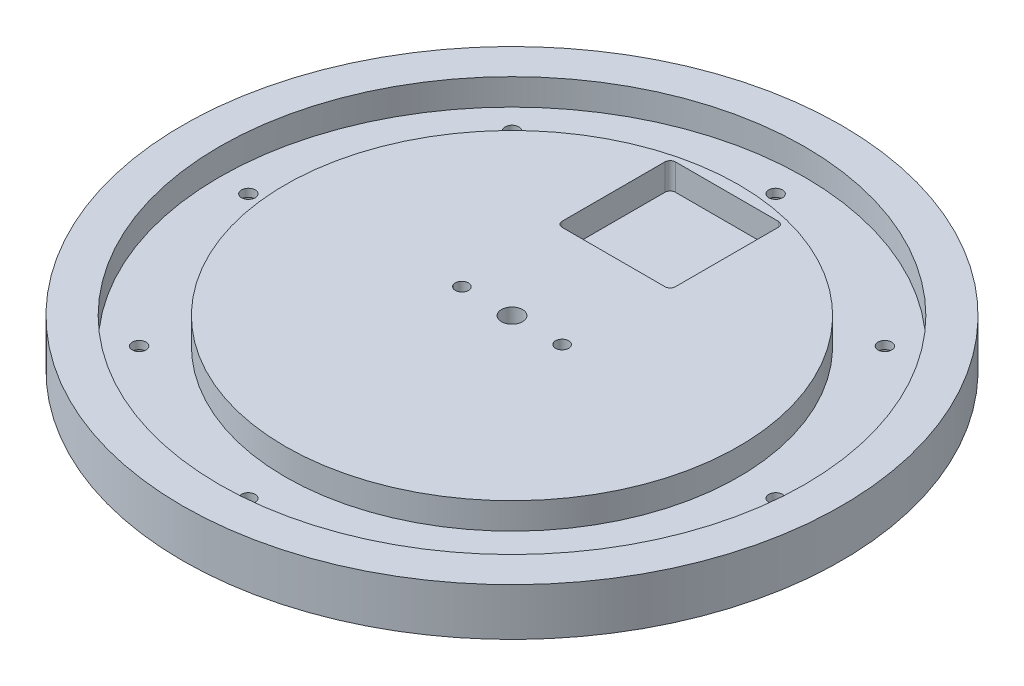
ISO-10303-21;
HEADER;
FILE_DESCRIPTION(('STEP AP214'),'2;1');
FILE_NAME('part.step','',(''),(''),'','','');
FILE_SCHEMA(('AUTOMOTIVE_DESIGN { 1 0 10303 214 1 1 1 1 }'));
ENDSEC;
DATA;
#1=APPLICATION_CONTEXT('core data for automotive mechanical design processes');
#2=APPLICATION_PROTOCOL_DEFINITION('international standard','automotive_design',2000,#1);
#3=PRODUCT_CONTEXT('',#1,'mechanical');
#4=PRODUCT('Part','Part','',(#3));
#5=PRODUCT_RELATED_PRODUCT_CATEGORY('part','',(#4));
#6=PRODUCT_DEFINITION_FORMATION('','',#4);
#7=PRODUCT_DEFINITION_CONTEXT('part definition',#1,'design');
#8=PRODUCT_DEFINITION('design','',#6,#7);
#9=PRODUCT_DEFINITION_SHAPE('','',#8);
#10=(LENGTH_UNIT() NAMED_UNIT(*) SI_UNIT(.MILLI.,.METRE.));
#11=(NAMED_UNIT(*) PLANE_ANGLE_UNIT() SI_UNIT($,.RADIAN.));
#12=(NAMED_UNIT(*) SI_UNIT($,.STERADIAN.) SOLID_ANGLE_UNIT());
#13=UNCERTAINTY_MEASURE_WITH_UNIT(LENGTH_MEASURE(1.E-05),#10,'distance_accuracy_value','');
#14=(GEOMETRIC_REPRESENTATION_CONTEXT(3) GLOBAL_UNCERTAINTY_ASSIGNED_CONTEXT((#13)) GLOBAL_UNIT_ASSIGNED_CONTEXT((#10,
#11,#12)) REPRESENTATION_CONTEXT('',''));
#15=CARTESIAN_POINT('',(0.,0.,0.));
#16=DIRECTION('',(0.,0.,1.));
#17=DIRECTION('',(1.,0.,0.));
#18=AXIS2_PLACEMENT_3D('',#15,#16,#17);
#19=CARTESIAN_POINT('',(0.,0.,0.));
#20=DIRECTION('',(0.,1.,0.));
#21=DIRECTION('',(0.,0.,1.));
#22=AXIS2_PLACEMENT_3D('',#19,#20,#21);
#23=CYLINDRICAL_SURFACE('',#22,4.);
#24=CARTESIAN_POINT('',(0.,18.,0.));
#25=DIRECTION('',(0.,1.,0.));
#26=DIRECTION('',(0.,0.,1.));
#27=AXIS2_PLACEMENT_3D('',#24,#25,#26);
#28=CIRCLE('',#27,4.);
#29=CARTESIAN_POINT('',(0.,18.,4.));
#30=VERTEX_POINT('',#29);
#31=EDGE_CURVE('E193',#30,#30,#28,.T.);
#32=ORIENTED_EDGE('',*,*,#31,.T.);
#33=EDGE_LOOP('',(#32));
#34=FACE_BOUND('',#33,.T.);
#35=CARTESIAN_POINT('',(0.,8.,0.));
#36=DIRECTION('',(0.,-1.,0.));
#37=DIRECTION('',(0.,0.,-1.));
#38=AXIS2_PLACEMENT_3D('',#35,#36,#37);
#39=CIRCLE('',#38,4.);
#40=CARTESIAN_POINT('',(0.,8.,-4.));
#41=VERTEX_POINT('',#40);
#42=EDGE_CURVE('E147',#41,#41,#39,.F.);
#43=ORIENTED_EDGE('',*,*,#42,.F.);
#44=EDGE_LOOP('',(#43));
#45=FACE_BOUND('',#44,.T.);
#46=ADVANCED_FACE('F33',(#34,#45),#23,.F.);
#47=CARTESIAN_POINT('',(100.,10.,0.));
#48=DIRECTION('',(0.,-1.,0.));
#49=DIRECTION('',(0.,0.,-1.));
#50=AXIS2_PLACEMENT_3D('',#47,#48,#49);
#51=CYLINDRICAL_SURFACE('',#50,2.6);
#52=CARTESIAN_POINT('',(100.,8.,0.));
#53=DIRECTION('',(0.,1.,0.));
#54=DIRECTION('',(0.,0.,1.));
#55=AXIS2_PLACEMENT_3D('',#52,#53,#54);
#56=CIRCLE('',#55,2.6);
#57=CARTESIAN_POINT('',(100.,8.,2.6));
#58=VERTEX_POINT('',#57);
#59=EDGE_CURVE('E209',#58,#58,#56,.T.);
#60=ORIENTED_EDGE('',*,*,#59,.T.);
#61=EDGE_LOOP('',(#60));
#62=FACE_BOUND('',#61,.T.);
#63=CARTESIAN_POINT('',(100.,5.,0.));
#64=DIRECTION('',(0.,-1.,0.));
#65=DIRECTION('',(0.,0.,-1.));
#66=AXIS2_PLACEMENT_3D('',#63,#64,#65);
#67=CIRCLE('',#66,2.6);
#68=CARTESIAN_POINT('',(100.,5.,-2.6));
#69=VERTEX_POINT('',#68);
#70=EDGE_CURVE('E201',#69,#69,#67,.F.);
#71=ORIENTED_EDGE('',*,*,#70,.F.);
#72=EDGE_LOOP('',(#71));
#73=FACE_BOUND('',#72,.T.);
#74=ADVANCED_FACE('F327',(#62,#73),#51,.F.);
#75=CARTESIAN_POINT('',(70.7106781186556,10.,70.7106781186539));
#76=DIRECTION('',(0.,-1.,0.));
#77=DIRECTION('',(0.,0.,-1.));
#78=AXIS2_PLACEMENT_3D('',#75,#76,#77);
#79=CYLINDRICAL_SURFACE('',#78,2.6);
#80=CARTESIAN_POINT('',(70.7106781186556,8.,70.7106781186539));
#81=DIRECTION('',(0.,1.,0.));
#82=DIRECTION('',(0.,0.,1.));
#83=AXIS2_PLACEMENT_3D('',#80,#81,#82);
#84=CIRCLE('',#83,2.6);
#85=CARTESIAN_POINT('',(70.7106781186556,8.,73.3106781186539));
#86=VERTEX_POINT('',#85);
#87=EDGE_CURVE('E224',#86,#86,#84,.T.);
#88=ORIENTED_EDGE('',*,*,#87,.T.);
#89=EDGE_LOOP('',(#88));
#90=FACE_BOUND('',#89,.T.);
#91=CARTESIAN_POINT('',(70.7106781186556,5.,70.7106781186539));
#92=DIRECTION('',(0.,-1.,0.));
#93=DIRECTION('',(0.,0.,-1.));
#94=AXIS2_PLACEMENT_3D('',#91,#92,#93);
#95=CIRCLE('',#94,2.6);
#96=CARTESIAN_POINT('',(70.7106781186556,5.,68.1106781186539));
#97=VERTEX_POINT('',#96);
#98=EDGE_CURVE('E260',#97,#97,#95,.F.);
#99=ORIENTED_EDGE('',*,*,#98,.F.);
#100=EDGE_LOOP('',(#99));
#101=FACE_BOUND('',#100,.T.);
#102=ADVANCED_FACE('F335',(#90,#101),#79,.F.);
#103=CARTESIAN_POINT('',(-70.7106781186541,10.,70.7106781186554));
#104=DIRECTION('',(0.,-1.,0.));
#105=DIRECTION('',(0.,0.,-1.));
#106=AXIS2_PLACEMENT_3D('',#103,#104,#105);
#107=CYLINDRICAL_SURFACE('',#106,2.6);
#108=CARTESIAN_POINT('',(-70.7106781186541,8.,70.7106781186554));
#109=DIRECTION('',(0.,1.,0.));
#110=DIRECTION('',(0.,0.,1.));
#111=AXIS2_PLACEMENT_3D('',#108,#109,#110);
#112=CIRCLE('',#111,2.6);
#113=CARTESIAN_POINT('',(-70.7106781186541,8.,73.3106781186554));
#114=VERTEX_POINT('',#113);
#115=EDGE_CURVE('E230',#114,#114,#112,.T.);
#116=ORIENTED_EDGE('',*,*,#115,.T.);
#117=EDGE_LOOP('',(#116));
#118=FACE_BOUND('',#117,.T.);
#119=CARTESIAN_POINT('',(-70.7106781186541,5.,70.7106781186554));
#120=DIRECTION('',(0.,-1.,0.));
#121=DIRECTION('',(0.,0.,-1.));
#122=AXIS2_PLACEMENT_3D('',#119,#120,#121);
#123=CIRCLE('',#122,2.6);
#124=CARTESIAN_POINT('',(-70.7106781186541,5.,68.1106781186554));
#125=VERTEX_POINT('',#124);
#126=EDGE_CURVE('E257',#125,#125,#123,.F.);
#127=ORIENTED_EDGE('',*,*,#126,.F.);
#128=EDGE_LOOP('',(#127));
#129=FACE_BOUND('',#128,.T.);
#130=ADVANCED_FACE('F423',(#118,#129),#107,.F.);
#131=CARTESIAN_POINT('',(-100.,10.,6.98296267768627E-13));
#132=DIRECTION('',(0.,-1.,0.));
#133=DIRECTION('',(0.,0.,-1.));
#134=AXIS2_PLACEMENT_3D('',#131,#132,#133);
#135=CYLINDRICAL_SURFACE('',#134,2.6);
#136=CARTESIAN_POINT('',(-100.,8.,6.98296267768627E-13));
#137=DIRECTION('',(0.,1.,0.));
#138=DIRECTION('',(0.,0.,1.));
#139=AXIS2_PLACEMENT_3D('',#136,#137,#138);
#140=CIRCLE('',#139,2.6);
#141=CARTESIAN_POINT('',(-100.,8.,2.6000000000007));
#142=VERTEX_POINT('',#141);
#143=EDGE_CURVE('E233',#142,#142,#140,.T.);
#144=ORIENTED_EDGE('',*,*,#143,.T.);
#145=EDGE_LOOP('',(#144));
#146=FACE_BOUND('',#145,.T.);
#147=CARTESIAN_POINT('',(-100.,5.,6.98296267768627E-13));
#148=DIRECTION('',(0.,-1.,0.));
#149=DIRECTION('',(0.,0.,-1.));
#150=AXIS2_PLACEMENT_3D('',#147,#148,#149);
#151=CIRCLE('',#150,2.6);
#152=CARTESIAN_POINT('',(-100.,5.,-2.59999999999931));
#153=VERTEX_POINT('',#152);
#154=EDGE_CURVE('E254',#153,#153,#151,.F.);
#155=ORIENTED_EDGE('',*,*,#154,.F.);
#156=EDGE_LOOP('',(#155));
#157=FACE_BOUND('',#156,.T.);
#158=ADVANCED_FACE('F419',(#146,#157),#135,.F.);
#159=CARTESIAN_POINT('',(-70.7106781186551,10.,-70.7106781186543));
#160=DIRECTION('',(0.,-1.,0.));
#161=DIRECTION('',(0.,0.,-1.));
#162=AXIS2_PLACEMENT_3D('',#159,#160,#161);
#163=CYLINDRICAL_SURFACE('',#162,2.6);
#164=CARTESIAN_POINT('',(-70.7106781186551,8.,-70.7106781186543));
#165=DIRECTION('',(0.,1.,0.));
#166=DIRECTION('',(0.,0.,1.));
#167=AXIS2_PLACEMENT_3D('',#164,#165,#166);
#168=CIRCLE('',#167,2.6);
#169=CARTESIAN_POINT('',(-70.7106781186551,8.,-68.1106781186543));
#170=VERTEX_POINT('',#169);
#171=EDGE_CURVE('E236',#170,#170,#168,.T.);
#172=ORIENTED_EDGE('',*,*,#171,.T.);
#173=EDGE_LOOP('',(#172));
#174=FACE_BOUND('',#173,.T.);
#175=CARTESIAN_POINT('',(-70.7106781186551,5.,-70.7106781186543));
#176=DIRECTION('',(0.,-1.,0.));
#177=DIRECTION('',(0.,0.,-1.));
#178=AXIS2_PLACEMENT_3D('',#175,#176,#177);
#179=CIRCLE('',#178,2.6);
#180=CARTESIAN_POINT('',(-70.7106781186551,5.,-73.3106781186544));
#181=VERTEX_POINT('',#180);
#182=EDGE_CURVE('E251',#181,#181,#179,.F.);
#183=ORIENTED_EDGE('',*,*,#182,.F.);
#184=EDGE_LOOP('',(#183));
#185=FACE_BOUND('',#184,.T.);
#186=ADVANCED_FACE('F415',(#174,#185),#163,.F.);
#187=CARTESIAN_POINT('',(-3.49148133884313E-13,10.,-100.));
#188=DIRECTION('',(0.,-1.,0.));
#189=DIRECTION('',(0.,0.,-1.));
#190=AXIS2_PLACEMENT_3D('',#187,#188,#189);
#191=CYLINDRICAL_SURFACE('',#190,2.6);
#192=CARTESIAN_POINT('',(-3.49148133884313E-13,8.,-100.));
#193=DIRECTION('',(0.,1.,0.));
#194=DIRECTION('',(0.,0.,1.));
#195=AXIS2_PLACEMENT_3D('',#192,#193,#194);
#196=CIRCLE('',#195,2.6);
#197=CARTESIAN_POINT('',(-3.49148133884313E-13,8.,-97.4));
#198=VERTEX_POINT('',#197);
#199=EDGE_CURVE('E239',#198,#198,#196,.T.);
#200=ORIENTED_EDGE('',*,*,#199,.T.);
#201=EDGE_LOOP('',(#200));
#202=FACE_BOUND('',#201,.T.);
#203=CARTESIAN_POINT('',(-3.49148133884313E-13,5.,-100.));
#204=DIRECTION('',(0.,-1.,0.));
#205=DIRECTION('',(0.,0.,-1.));
#206=AXIS2_PLACEMENT_3D('',#203,#204,#205);
#207=CIRCLE('',#206,2.6);
#208=CARTESIAN_POINT('',(-3.49148133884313E-13,5.,-102.6));
#209=VERTEX_POINT('',#208);
#210=EDGE_CURVE('E248',#209,#209,#207,.F.);
#211=ORIENTED_EDGE('',*,*,#210,.F.);
#212=EDGE_LOOP('',(#211));
#213=FACE_BOUND('',#212,.T.);
#214=ADVANCED_FACE('F411',(#202,#213),#191,.F.);
#215=CARTESIAN_POINT('',(70.7106781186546,10.,-70.7106781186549));
#216=DIRECTION('',(0.,-1.,0.));
#217=DIRECTION('',(0.,0.,-1.));
#218=AXIS2_PLACEMENT_3D('',#215,#216,#217);
#219=CYLINDRICAL_SURFACE('',#218,2.6);
#220=CARTESIAN_POINT('',(70.7106781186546,8.,-70.7106781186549));
#221=DIRECTION('',(0.,1.,0.));
#222=DIRECTION('',(0.,0.,1.));
#223=AXIS2_PLACEMENT_3D('',#220,#221,#222);
#224=CIRCLE('',#223,2.6);
#225=CARTESIAN_POINT('',(70.7106781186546,8.,-68.1106781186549));
#226=VERTEX_POINT('',#225);
#227=EDGE_CURVE('E223',#226,#226,#224,.T.);
#228=ORIENTED_EDGE('',*,*,#227,.T.);
#229=EDGE_LOOP('',(#228));
#230=FACE_BOUND('',#229,.T.);
#231=CARTESIAN_POINT('',(70.7106781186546,5.,-70.7106781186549));
#232=DIRECTION('',(0.,-1.,0.));
#233=DIRECTION('',(0.,0.,-1.));
#234=AXIS2_PLACEMENT_3D('',#231,#232,#233);
#235=CIRCLE('',#234,2.6);
#236=CARTESIAN_POINT('',(70.7106781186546,5.,-73.3106781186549));
#237=VERTEX_POINT('',#236);
#238=EDGE_CURVE('E153',#237,#237,#235,.F.);
#239=ORIENTED_EDGE('',*,*,#238,.F.);
#240=EDGE_LOOP('',(#239));
#241=FACE_BOUND('',#240,.T.);
#242=ADVANCED_FACE('F407',(#230,#241),#219,.F.);
#243=CARTESIAN_POINT('',(1.04744440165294E-12,10.,100.));
#244=DIRECTION('',(0.,-1.,0.));
#245=DIRECTION('',(0.,0.,-1.));
#246=AXIS2_PLACEMENT_3D('',#243,#244,#245);
#247=CYLINDRICAL_SURFACE('',#246,2.6);
#248=CARTESIAN_POINT('',(1.04744440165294E-12,8.,100.));
#249=DIRECTION('',(0.,1.,0.));
#250=DIRECTION('',(0.,0.,1.));
#251=AXIS2_PLACEMENT_3D('',#248,#249,#250);
#252=CIRCLE('',#251,2.6);
#253=CARTESIAN_POINT('',(1.04744440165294E-12,8.,102.6));
#254=VERTEX_POINT('',#253);
#255=EDGE_CURVE('E227',#254,#254,#252,.T.);
#256=ORIENTED_EDGE('',*,*,#255,.T.);
#257=EDGE_LOOP('',(#256));
#258=FACE_BOUND('',#257,.T.);
#259=CARTESIAN_POINT('',(1.04744440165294E-12,5.,100.));
#260=DIRECTION('',(0.,-1.,0.));
#261=DIRECTION('',(0.,0.,-1.));
#262=AXIS2_PLACEMENT_3D('',#259,#260,#261);
#263=CIRCLE('',#262,2.6);
#264=CARTESIAN_POINT('',(1.04744440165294E-12,5.,97.4));
#265=VERTEX_POINT('',#264);
#266=EDGE_CURVE('E197',#265,#265,#263,.F.);
#267=ORIENTED_EDGE('',*,*,#266,.F.);
#268=EDGE_LOOP('',(#267));
#269=FACE_BOUND('',#268,.T.);
#270=ADVANCED_FACE('F410',(#258,#269),#247,.F.);
#271=CARTESIAN_POINT('',(0.,18.,0.));
#272=DIRECTION('',(0.,-1.,0.));
#273=DIRECTION('',(0.,0.,-1.));
#274=AXIS2_PLACEMENT_3D('',#271,#272,#273);
#275=CYLINDRICAL_SURFACE('',#274,125.);
#276=CARTESIAN_POINT('',(0.,18.,0.));
#277=DIRECTION('',(0.,1.,0.));
#278=DIRECTION('',(0.,0.,1.));
#279=AXIS2_PLACEMENT_3D('',#276,#277,#278);
#280=CIRCLE('',#279,125.);
#281=CARTESIAN_POINT('',(0.,18.,125.));
#282=VERTEX_POINT('',#281);
#283=EDGE_CURVE('E216',#282,#282,#280,.T.);
#284=ORIENTED_EDGE('',*,*,#283,.F.);
#285=EDGE_LOOP('',(#284));
#286=FACE_BOUND('',#285,.T.);
#287=CARTESIAN_POINT('',(0.,0.,0.));
#288=DIRECTION('',(0.,1.,0.));
#289=DIRECTION('',(0.,0.,1.));
#290=AXIS2_PLACEMENT_3D('',#287,#288,#289);
#291=CIRCLE('',#290,125.);
#292=CARTESIAN_POINT('',(0.,0.,125.));
#293=VERTEX_POINT('',#292);
#294=EDGE_CURVE('E213',#293,#293,#291,.T.);
#295=ORIENTED_EDGE('',*,*,#294,.T.);
#296=EDGE_LOOP('',(#295));
#297=FACE_BOUND('',#296,.T.);
#298=ADVANCED_FACE('F430',(#286,#297),#275,.T.);
#299=CARTESIAN_POINT('',(0.,18.,0.));
#300=DIRECTION('',(0.,1.,0.));
#301=DIRECTION('',(0.,0.,1.));
#302=AXIS2_PLACEMENT_3D('',#299,#300,#301);
#303=PLANE('',#302);
#304=CARTESIAN_POINT('',(0.,18.,0.));
#305=DIRECTION('',(0.,1.,0.));
#306=DIRECTION('',(0.,0.,1.));
#307=AXIS2_PLACEMENT_3D('',#304,#305,#306);
#308=CIRCLE('',#307,111.);
#309=CARTESIAN_POINT('',(0.,18.,111.));
#310=VERTEX_POINT('',#309);
#311=EDGE_CURVE('E205',#310,#310,#308,.T.);
#312=ORIENTED_EDGE('',*,*,#311,.F.);
#313=EDGE_LOOP('',(#312));
#314=FACE_BOUND('',#313,.T.);
#315=ORIENTED_EDGE('',*,*,#283,.T.);
#316=EDGE_LOOP('',(#315));
#317=FACE_BOUND('',#316,.T.);
#318=ADVANCED_FACE('F448',(#314,#317),#303,.T.);
#319=CARTESIAN_POINT('',(0.,0.,0.));
#320=DIRECTION('',(0.,1.,0.));
#321=DIRECTION('',(0.,0.,1.));
#322=AXIS2_PLACEMENT_3D('',#319,#320,#321);
#323=PLANE('',#322);
#324=CARTESIAN_POINT('',(-19.,0.,0.));
#325=DIRECTION('',(0.,1.,0.));
#326=DIRECTION('',(0.,0.,1.));
#327=AXIS2_PLACEMENT_3D('',#324,#325,#326);
#328=CIRCLE('',#327,2.5);
#329=CARTESIAN_POINT('',(-19.,0.,2.5));
#330=VERTEX_POINT('',#329);
#331=EDGE_CURVE('E130',#330,#330,#328,.T.);
#332=ORIENTED_EDGE('',*,*,#331,.T.);
#333=EDGE_LOOP('',(#332));
#334=FACE_BOUND('',#333,.T.);
#335=CARTESIAN_POINT('',(19.,0.,0.));
#336=DIRECTION('',(0.,1.,0.));
#337=DIRECTION('',(0.,0.,1.));
#338=AXIS2_PLACEMENT_3D('',#335,#336,#337);
#339=CIRCLE('',#338,2.5);
#340=CARTESIAN_POINT('',(19.,0.,2.5));
#341=VERTEX_POINT('',#340);
#342=EDGE_CURVE('E138',#341,#341,#339,.T.);
#343=ORIENTED_EDGE('',*,*,#342,.T.);
#344=EDGE_LOOP('',(#343));
#345=FACE_BOUND('',#344,.T.);
#346=CARTESIAN_POINT('',(0.,0.,0.));
#347=DIRECTION('',(0.,-1.,0.));
#348=DIRECTION('',(0.,0.,-1.));
#349=AXIS2_PLACEMENT_3D('',#346,#347,#348);
#350=CIRCLE('',#349,10.);
#351=CARTESIAN_POINT('',(0.,0.,-10.));
#352=VERTEX_POINT('',#351);
#353=EDGE_CURVE('E141',#352,#352,#350,.T.);
#354=ORIENTED_EDGE('',*,*,#353,.F.);
#355=EDGE_LOOP('',(#354));
#356=FACE_BOUND('',#355,.T.);
#357=CARTESIAN_POINT('',(70.710678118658,0.,70.71067811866));
#358=DIRECTION('',(0.,-1.,0.));
#359=DIRECTION('',(0.,0.,-1.));
#360=AXIS2_PLACEMENT_3D('',#357,#358,#359);
#361=CIRCLE('',#360,5.00000000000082);
#362=CARTESIAN_POINT('',(70.710678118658,0.,65.7106781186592));
#363=VERTEX_POINT('',#362);
#364=EDGE_CURVE('E154',#363,#363,#361,.T.);
#365=ORIENTED_EDGE('',*,*,#364,.F.);
#366=EDGE_LOOP('',(#365));
#367=FACE_BOUND('',#366,.T.);
#368=CARTESIAN_POINT('',(100.000000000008,0.,7.44845225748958E-12));
#369=DIRECTION('',(0.,-1.,0.));
#370=DIRECTION('',(0.,0.,-1.));
#371=AXIS2_PLACEMENT_3D('',#368,#369,#370);
#372=CIRCLE('',#371,5.00000000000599);
#373=CARTESIAN_POINT('',(100.000000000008,0.,-4.99999999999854));
#374=VERTEX_POINT('',#373);
#375=EDGE_CURVE('E160',#374,#374,#372,.T.);
#376=ORIENTED_EDGE('',*,*,#375,.F.);
#377=EDGE_LOOP('',(#376));
#378=FACE_BOUND('',#377,.T.);
#379=CARTESIAN_POINT('',(70.7106781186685,0.,-70.7106781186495));
#380=DIRECTION('',(0.,-1.,0.));
#381=DIRECTION('',(0.,0.,-1.));
#382=AXIS2_PLACEMENT_3D('',#379,#380,#381);
#383=CIRCLE('',#382,5.00000000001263);
#384=CARTESIAN_POINT('',(70.7106781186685,0.,-75.7106781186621));
#385=VERTEX_POINT('',#384);
#386=EDGE_CURVE('E166',#385,#385,#383,.T.);
#387=ORIENTED_EDGE('',*,*,#386,.F.);
#388=EDGE_LOOP('',(#387));
#389=FACE_BOUND('',#388,.T.);
#390=CARTESIAN_POINT('',(1.59443489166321E-11,0.,-100.));
#391=DIRECTION('',(0.,-1.,0.));
#392=DIRECTION('',(0.,0.,-1.));
#393=AXIS2_PLACEMENT_3D('',#390,#391,#392);
#394=CIRCLE('',#393,5.00000000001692);
#395=CARTESIAN_POINT('',(1.59443489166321E-11,0.,-105.000000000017));
#396=VERTEX_POINT('',#395);
#397=EDGE_CURVE('E172',#396,#396,#394,.T.);
#398=ORIENTED_EDGE('',*,*,#397,.F.);
#399=EDGE_LOOP('',(#398));
#400=FACE_BOUND('',#399,.T.);
#401=CARTESIAN_POINT('',(-70.710678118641,0.,-70.71067811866));
#402=DIRECTION('',(0.,-1.,0.));
#403=DIRECTION('',(0.,0.,-1.));
#404=AXIS2_PLACEMENT_3D('',#401,#402,#403);
#405=CIRCLE('',#404,5.00000000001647);
#406=CARTESIAN_POINT('',(-70.710678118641,0.,-75.7106781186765));
#407=VERTEX_POINT('',#406);
#408=EDGE_CURVE('E178',#407,#407,#405,.T.);
#409=ORIENTED_EDGE('',*,*,#408,.F.);
#410=EDGE_LOOP('',(#409));
#411=FACE_BOUND('',#410,.T.);
#412=CARTESIAN_POINT('',(-99.9999999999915,0.,-7.46069872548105E-12));
#413=DIRECTION('',(0.,-1.,0.));
#414=DIRECTION('',(0.,0.,-1.));
#415=AXIS2_PLACEMENT_3D('',#412,#413,#414);
#416=CIRCLE('',#415,5.00000000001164);
#417=CARTESIAN_POINT('',(-99.9999999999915,0.,-5.0000000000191));
#418=VERTEX_POINT('',#417);
#419=EDGE_CURVE('E184',#418,#418,#416,.T.);
#420=ORIENTED_EDGE('',*,*,#419,.F.);
#421=EDGE_LOOP('',(#420));
#422=FACE_BOUND('',#421,.T.);
#423=CARTESIAN_POINT('',(-70.7106781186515,0.,70.7106781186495));
#424=DIRECTION('',(0.,-1.,0.));
#425=DIRECTION('',(0.,0.,-1.));
#426=AXIS2_PLACEMENT_3D('',#423,#424,#425);
#427=CIRCLE('',#426,5.00000000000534);
#428=CARTESIAN_POINT('',(-70.7106781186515,0.,65.7106781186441));
#429=VERTEX_POINT('',#428);
#430=EDGE_CURVE('E190',#429,#429,#427,.T.);
#431=ORIENTED_EDGE('',*,*,#430,.F.);
#432=EDGE_LOOP('',(#431));
#433=FACE_BOUND('',#432,.T.);
#434=CARTESIAN_POINT('',(1.04744440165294E-12,0.,100.));
#435=DIRECTION('',(0.,-1.,0.));
#436=DIRECTION('',(0.,0.,-1.));
#437=AXIS2_PLACEMENT_3D('',#434,#435,#436);
#438=CIRCLE('',#437,5.);
#439=CARTESIAN_POINT('',(1.04744440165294E-12,0.,95.));
#440=VERTEX_POINT('',#439);
#441=EDGE_CURVE('E198',#440,#440,#438,.T.);
#442=ORIENTED_EDGE('',*,*,#441,.F.);
#443=EDGE_LOOP('',(#442));
#444=FACE_BOUND('',#443,.T.);
#445=ORIENTED_EDGE('',*,*,#294,.F.);
#446=EDGE_LOOP('',(#445));
#447=FACE_BOUND('',#446,.T.);
#448=ADVANCED_FACE('F446',(#334,#345,#356,#367,#378,#389,#400,#411,#422,#433,#444,#447),#323,.F.);
#449=CARTESIAN_POINT('',(0.,8.,0.));
#450=DIRECTION('',(0.,1.,0.));
#451=DIRECTION('',(0.,0.,1.));
#452=AXIS2_PLACEMENT_3D('',#449,#450,#451);
#453=CYLINDRICAL_SURFACE('',#452,111.);
#454=CARTESIAN_POINT('',(0.,8.,0.));
#455=DIRECTION('',(0.,1.,0.));
#456=DIRECTION('',(0.,0.,1.));
#457=AXIS2_PLACEMENT_3D('',#454,#455,#456);
#458=CIRCLE('',#457,111.);
#459=CARTESIAN_POINT('',(0.,8.,111.));
#460=VERTEX_POINT('',#459);
#461=EDGE_CURVE('E210',#460,#460,#458,.T.);
#462=ORIENTED_EDGE('',*,*,#461,.F.);
#463=EDGE_LOOP('',(#462));
#464=FACE_BOUND('',#463,.T.);
#465=ORIENTED_EDGE('',*,*,#311,.T.);
#466=EDGE_LOOP('',(#465));
#467=FACE_BOUND('',#466,.T.);
#468=ADVANCED_FACE('F442',(#464,#467),#453,.F.);
#469=CARTESIAN_POINT('',(0.,8.,0.));
#470=DIRECTION('',(0.,1.,0.));
#471=DIRECTION('',(0.,0.,1.));
#472=AXIS2_PLACEMENT_3D('',#469,#470,#471);
#473=PLANE('',#472);
#474=ORIENTED_EDGE('',*,*,#227,.F.);
#475=EDGE_LOOP('',(#474));
#476=FACE_BOUND('',#475,.T.);
#477=ORIENTED_EDGE('',*,*,#199,.F.);
#478=EDGE_LOOP('',(#477));
#479=FACE_BOUND('',#478,.T.);
#480=ORIENTED_EDGE('',*,*,#171,.F.);
#481=EDGE_LOOP('',(#480));
#482=FACE_BOUND('',#481,.T.);
#483=ORIENTED_EDGE('',*,*,#143,.F.);
#484=EDGE_LOOP('',(#483));
#485=FACE_BOUND('',#484,.T.);
#486=ORIENTED_EDGE('',*,*,#115,.F.);
#487=EDGE_LOOP('',(#486));
#488=FACE_BOUND('',#487,.T.);
#489=ORIENTED_EDGE('',*,*,#255,.F.);
#490=EDGE_LOOP('',(#489));
#491=FACE_BOUND('',#490,.T.);
#492=ORIENTED_EDGE('',*,*,#87,.F.);
#493=EDGE_LOOP('',(#492));
#494=FACE_BOUND('',#493,.T.);
#495=ORIENTED_EDGE('',*,*,#59,.F.);
#496=EDGE_LOOP('',(#495));
#497=FACE_BOUND('',#496,.T.);
#498=CARTESIAN_POINT('',(0.,8.,0.));
#499=DIRECTION('',(0.,1.,0.));
#500=DIRECTION('',(0.,0.,1.));
#501=AXIS2_PLACEMENT_3D('',#498,#499,#500);
#502=CIRCLE('',#501,86.);
#503=CARTESIAN_POINT('',(0.,8.,86.));
#504=VERTEX_POINT('',#503);
#505=EDGE_CURVE('E202',#504,#504,#502,.T.);
#506=ORIENTED_EDGE('',*,*,#505,.F.);
#507=EDGE_LOOP('',(#506));
#508=FACE_BOUND('',#507,.T.);
#509=ORIENTED_EDGE('',*,*,#461,.T.);
#510=EDGE_LOOP('',(#509));
#511=FACE_BOUND('',#510,.T.);
#512=ADVANCED_FACE('F438',(#476,#479,#482,#485,#488,#491,#494,#497,#508,#511),#473,.T.);
#513=CARTESIAN_POINT('',(0.,8.,0.));
#514=DIRECTION('',(0.,1.,0.));
#515=DIRECTION('',(0.,0.,1.));
#516=AXIS2_PLACEMENT_3D('',#513,#514,#515);
#517=CYLINDRICAL_SURFACE('',#516,86.);
#518=ORIENTED_EDGE('',*,*,#505,.T.);
#519=EDGE_LOOP('',(#518));
#520=FACE_BOUND('',#519,.T.);
#521=CARTESIAN_POINT('',(0.,18.,0.));
#522=DIRECTION('',(0.,1.,0.));
#523=DIRECTION('',(0.,0.,1.));
#524=AXIS2_PLACEMENT_3D('',#521,#522,#523);
#525=CIRCLE('',#524,86.);
#526=CARTESIAN_POINT('',(0.,18.,86.));
#527=VERTEX_POINT('',#526);
#528=EDGE_CURVE('E206',#527,#527,#525,.T.);
#529=ORIENTED_EDGE('',*,*,#528,.F.);
#530=EDGE_LOOP('',(#529));
#531=FACE_BOUND('',#530,.T.);
#532=ADVANCED_FACE('F435',(#520,#531),#517,.T.);
#533=DIRECTION('',(0.,0.,1.));
#534=VECTOR('',#533,1.);
#535=CARTESIAN_POINT('',(-21.5,18.,-81.5));
#536=LINE('',#535,#534);
#537=CARTESIAN_POINT('',(-21.5,18.,-79.5));
#538=VERTEX_POINT('',#537);
#539=CARTESIAN_POINT('',(-21.5,18.,-40.5));
#540=VERTEX_POINT('',#539);
#541=EDGE_CURVE('E126',#538,#540,#536,.T.);
#542=ORIENTED_EDGE('',*,*,#541,.F.);
#543=CARTESIAN_POINT('',(-19.5,18.,-79.5));
#544=DIRECTION('',(0.,1.,0.));
#545=DIRECTION('',(0.,0.,1.));
#546=AXIS2_PLACEMENT_3D('',#543,#544,#545);
#547=CIRCLE('',#546,2.);
#548=CARTESIAN_POINT('',(-19.5,18.,-81.5));
#549=VERTEX_POINT('',#548);
#550=EDGE_CURVE('E11',#538,#549,#547,.F.);
#551=ORIENTED_EDGE('',*,*,#550,.T.);
#552=DIRECTION('',(-1.,0.,0.));
#553=VECTOR('',#552,1.);
#554=CARTESIAN_POINT('',(-21.5,18.,-81.5));
#555=LINE('',#554,#553);
#556=CARTESIAN_POINT('',(19.5,18.,-81.5));
#557=VERTEX_POINT('',#556);
#558=EDGE_CURVE('E121',#557,#549,#555,.T.);
#559=ORIENTED_EDGE('',*,*,#558,.F.);
#560=CARTESIAN_POINT('',(19.5,18.,-79.5));
#561=DIRECTION('',(0.,1.,0.));
#562=DIRECTION('',(0.,0.,1.));
#563=AXIS2_PLACEMENT_3D('',#560,#561,#562);
#564=CIRCLE('',#563,2.);
#565=CARTESIAN_POINT('',(21.5,18.,-79.5));
#566=VERTEX_POINT('',#565);
#567=EDGE_CURVE('E41',#557,#566,#564,.F.);
#568=ORIENTED_EDGE('',*,*,#567,.T.);
#569=DIRECTION('',(0.,0.,-1.));
#570=VECTOR('',#569,1.);
#571=CARTESIAN_POINT('',(21.5,18.,-81.5));
#572=LINE('',#571,#570);
#573=CARTESIAN_POINT('',(21.5,18.,-40.5));
#574=VERTEX_POINT('',#573);
#575=EDGE_CURVE('E113',#574,#566,#572,.T.);
#576=ORIENTED_EDGE('',*,*,#575,.F.);
#577=CARTESIAN_POINT('',(19.5,18.,-40.5));
#578=DIRECTION('',(0.,1.,0.));
#579=DIRECTION('',(0.,0.,1.));
#580=AXIS2_PLACEMENT_3D('',#577,#578,#579);
#581=CIRCLE('',#580,2.);
#582=CARTESIAN_POINT('',(19.5,18.,-38.5));
#583=VERTEX_POINT('',#582);
#584=EDGE_CURVE('E97',#574,#583,#581,.F.);
#585=ORIENTED_EDGE('',*,*,#584,.T.);
#586=DIRECTION('',(1.,0.,0.));
#587=VECTOR('',#586,1.);
#588=CARTESIAN_POINT('',(-21.5,18.,-38.5));
#589=LINE('',#588,#587);
#590=CARTESIAN_POINT('',(-19.5,18.,-38.5));
#591=VERTEX_POINT('',#590);
#592=EDGE_CURVE('E122',#591,#583,#589,.T.);
#593=ORIENTED_EDGE('',*,*,#592,.F.);
#594=CARTESIAN_POINT('',(-19.5,18.,-40.5));
#595=DIRECTION('',(0.,1.,0.));
#596=DIRECTION('',(0.,0.,1.));
#597=AXIS2_PLACEMENT_3D('',#594,#595,#596);
#598=CIRCLE('',#597,2.);
#599=EDGE_CURVE('E106',#591,#540,#598,.F.);
#600=ORIENTED_EDGE('',*,*,#599,.T.);
#601=EDGE_LOOP('',(#542,#551,#559,#568,#576,#585,#593,#600));
#602=FACE_BOUND('',#601,.T.);
#603=CARTESIAN_POINT('',(-19.,18.,0.));
#604=DIRECTION('',(0.,1.,0.));
#605=DIRECTION('',(0.,0.,1.));
#606=AXIS2_PLACEMENT_3D('',#603,#604,#605);
#607=CIRCLE('',#606,2.5);
#608=CARTESIAN_POINT('',(-19.,18.,2.5));
#609=VERTEX_POINT('',#608);
#610=EDGE_CURVE('E134',#609,#609,#607,.T.);
#611=ORIENTED_EDGE('',*,*,#610,.F.);
#612=EDGE_LOOP('',(#611));
#613=FACE_BOUND('',#612,.T.);
#614=CARTESIAN_POINT('',(19.,18.,0.));
#615=DIRECTION('',(0.,1.,0.));
#616=DIRECTION('',(0.,0.,1.));
#617=AXIS2_PLACEMENT_3D('',#614,#615,#616);
#618=CIRCLE('',#617,2.5);
#619=CARTESIAN_POINT('',(19.,18.,2.5));
#620=VERTEX_POINT('',#619);
#621=EDGE_CURVE('E133',#620,#620,#618,.T.);
#622=ORIENTED_EDGE('',*,*,#621,.F.);
#623=EDGE_LOOP('',(#622));
#624=FACE_BOUND('',#623,.T.);
#625=ORIENTED_EDGE('',*,*,#31,.F.);
#626=EDGE_LOOP('',(#625));
#627=FACE_BOUND('',#626,.T.);
#628=ORIENTED_EDGE('',*,*,#528,.T.);
#629=EDGE_LOOP('',(#628));
#630=FACE_BOUND('',#629,.T.);
#631=ADVANCED_FACE('F119',(#602,#613,#624,#627,#630),#303,.T.);
#632=CARTESIAN_POINT('',(1.04744440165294E-12,5.,100.));
#633=DIRECTION('',(0.,-1.,0.));
#634=DIRECTION('',(0.,0.,-1.));
#635=AXIS2_PLACEMENT_3D('',#632,#633,#634);
#636=PLANE('',#635);
#637=CARTESIAN_POINT('',(1.04744440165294E-12,5.,100.));
#638=DIRECTION('',(0.,-1.,0.));
#639=DIRECTION('',(0.,0.,-1.));
#640=AXIS2_PLACEMENT_3D('',#637,#638,#639);
#641=CIRCLE('',#640,5.);
#642=CARTESIAN_POINT('',(1.04744440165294E-12,5.,95.));
#643=VERTEX_POINT('',#642);
#644=EDGE_CURVE('E194',#643,#643,#641,.T.);
#645=ORIENTED_EDGE('',*,*,#644,.T.);
#646=EDGE_LOOP('',(#645));
#647=FACE_BOUND('',#646,.T.);
#648=ORIENTED_EDGE('',*,*,#266,.T.);
#649=EDGE_LOOP('',(#648));
#650=FACE_BOUND('',#649,.T.);
#651=ADVANCED_FACE('F400',(#647,#650),#636,.T.);
#652=CARTESIAN_POINT('',(1.04744440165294E-12,5.,100.));
#653=DIRECTION('',(0.,-1.,0.));
#654=DIRECTION('',(0.,0.,-1.));
#655=AXIS2_PLACEMENT_3D('',#652,#653,#654);
#656=CYLINDRICAL_SURFACE('',#655,5.);
#657=ORIENTED_EDGE('',*,*,#644,.F.);
#658=EDGE_LOOP('',(#657));
#659=FACE_BOUND('',#658,.T.);
#660=ORIENTED_EDGE('',*,*,#441,.T.);
#661=EDGE_LOOP('',(#660));
#662=FACE_BOUND('',#661,.T.);
#663=ADVANCED_FACE('F364',(#659,#662),#656,.F.);
#664=CARTESIAN_POINT('',(70.7106781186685,5.,-70.7106781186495));
#665=DIRECTION('',(0.,-1.,0.));
#666=DIRECTION('',(0.,0.,-1.));
#667=AXIS2_PLACEMENT_3D('',#664,#665,#666);
#668=PLANE('',#667);
#669=CARTESIAN_POINT('',(70.7106781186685,5.,-70.7106781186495));
#670=DIRECTION('',(0.,-1.,0.));
#671=DIRECTION('',(0.,0.,-1.));
#672=AXIS2_PLACEMENT_3D('',#669,#670,#671);
#673=CIRCLE('',#672,5.00000000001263);
#674=CARTESIAN_POINT('',(70.7106781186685,5.,-75.7106781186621));
#675=VERTEX_POINT('',#674);
#676=EDGE_CURVE('E163',#675,#675,#673,.T.);
#677=ORIENTED_EDGE('',*,*,#676,.T.);
#678=EDGE_LOOP('',(#677));
#679=FACE_BOUND('',#678,.T.);
#680=ORIENTED_EDGE('',*,*,#238,.T.);
#681=EDGE_LOOP('',(#680));
#682=FACE_BOUND('',#681,.T.);
#683=ADVANCED_FACE('F360',(#679,#682),#668,.T.);
#684=CARTESIAN_POINT('',(70.7106781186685,5.,-70.7106781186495));
#685=DIRECTION('',(0.,-1.,0.));
#686=DIRECTION('',(0.,0.,-1.));
#687=AXIS2_PLACEMENT_3D('',#684,#685,#686);
#688=CYLINDRICAL_SURFACE('',#687,5.00000000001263);
#689=ORIENTED_EDGE('',*,*,#676,.F.);
#690=EDGE_LOOP('',(#689));
#691=FACE_BOUND('',#690,.T.);
#692=ORIENTED_EDGE('',*,*,#386,.T.);
#693=EDGE_LOOP('',(#692));
#694=FACE_BOUND('',#693,.T.);
#695=ADVANCED_FACE('F363',(#691,#694),#688,.F.);
#696=CARTESIAN_POINT('',(1.59443489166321E-11,5.,-100.));
#697=DIRECTION('',(0.,-1.,0.));
#698=DIRECTION('',(0.,0.,-1.));
#699=AXIS2_PLACEMENT_3D('',#696,#697,#698);
#700=PLANE('',#699);
#701=CARTESIAN_POINT('',(1.59443489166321E-11,5.,-100.));
#702=DIRECTION('',(0.,-1.,0.));
#703=DIRECTION('',(0.,0.,-1.));
#704=AXIS2_PLACEMENT_3D('',#701,#702,#703);
#705=CIRCLE('',#704,5.00000000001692);
#706=CARTESIAN_POINT('',(1.59443489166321E-11,5.,-105.000000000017));
#707=VERTEX_POINT('',#706);
#708=EDGE_CURVE('E169',#707,#707,#705,.T.);
#709=ORIENTED_EDGE('',*,*,#708,.T.);
#710=EDGE_LOOP('',(#709));
#711=FACE_BOUND('',#710,.T.);
#712=ORIENTED_EDGE('',*,*,#210,.T.);
#713=EDGE_LOOP('',(#712));
#714=FACE_BOUND('',#713,.T.);
#715=ADVANCED_FACE('F368',(#711,#714),#700,.T.);
#716=CARTESIAN_POINT('',(1.59443489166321E-11,5.,-100.));
#717=DIRECTION('',(0.,-1.,0.));
#718=DIRECTION('',(0.,0.,-1.));
#719=AXIS2_PLACEMENT_3D('',#716,#717,#718);
#720=CYLINDRICAL_SURFACE('',#719,5.00000000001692);
#721=ORIENTED_EDGE('',*,*,#708,.F.);
#722=EDGE_LOOP('',(#721));
#723=FACE_BOUND('',#722,.T.);
#724=ORIENTED_EDGE('',*,*,#397,.T.);
#725=EDGE_LOOP('',(#724));
#726=FACE_BOUND('',#725,.T.);
#727=ADVANCED_FACE('F372',(#723,#726),#720,.F.);
#728=CARTESIAN_POINT('',(-70.710678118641,5.,-70.71067811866));
#729=DIRECTION('',(0.,-1.,0.));
#730=DIRECTION('',(0.,0.,-1.));
#731=AXIS2_PLACEMENT_3D('',#728,#729,#730);
#732=PLANE('',#731);
#733=CARTESIAN_POINT('',(-70.710678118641,5.,-70.71067811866));
#734=DIRECTION('',(0.,-1.,0.));
#735=DIRECTION('',(0.,0.,-1.));
#736=AXIS2_PLACEMENT_3D('',#733,#734,#735);
#737=CIRCLE('',#736,5.00000000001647);
#738=CARTESIAN_POINT('',(-70.710678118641,5.,-75.7106781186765));
#739=VERTEX_POINT('',#738);
#740=EDGE_CURVE('E175',#739,#739,#737,.T.);
#741=ORIENTED_EDGE('',*,*,#740,.T.);
#742=EDGE_LOOP('',(#741));
#743=FACE_BOUND('',#742,.T.);
#744=ORIENTED_EDGE('',*,*,#182,.T.);
#745=EDGE_LOOP('',(#744));
#746=FACE_BOUND('',#745,.T.);
#747=ADVANCED_FACE('F376',(#743,#746),#732,.T.);
#748=CARTESIAN_POINT('',(-70.710678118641,5.,-70.71067811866));
#749=DIRECTION('',(0.,-1.,0.));
#750=DIRECTION('',(0.,0.,-1.));
#751=AXIS2_PLACEMENT_3D('',#748,#749,#750);
#752=CYLINDRICAL_SURFACE('',#751,5.00000000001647);
#753=ORIENTED_EDGE('',*,*,#740,.F.);
#754=EDGE_LOOP('',(#753));
#755=FACE_BOUND('',#754,.T.);
#756=ORIENTED_EDGE('',*,*,#408,.T.);
#757=EDGE_LOOP('',(#756));
#758=FACE_BOUND('',#757,.T.);
#759=ADVANCED_FACE('F380',(#755,#758),#752,.F.);
#760=CARTESIAN_POINT('',(-99.9999999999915,5.,-7.46069872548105E-12));
#761=DIRECTION('',(0.,-1.,0.));
#762=DIRECTION('',(0.,0.,-1.));
#763=AXIS2_PLACEMENT_3D('',#760,#761,#762);
#764=PLANE('',#763);
#765=CARTESIAN_POINT('',(-99.9999999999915,5.,-7.46069872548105E-12));
#766=DIRECTION('',(0.,-1.,0.));
#767=DIRECTION('',(0.,0.,-1.));
#768=AXIS2_PLACEMENT_3D('',#765,#766,#767);
#769=CIRCLE('',#768,5.00000000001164);
#770=CARTESIAN_POINT('',(-99.9999999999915,5.,-5.0000000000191));
#771=VERTEX_POINT('',#770);
#772=EDGE_CURVE('E181',#771,#771,#769,.T.);
#773=ORIENTED_EDGE('',*,*,#772,.T.);
#774=EDGE_LOOP('',(#773));
#775=FACE_BOUND('',#774,.T.);
#776=ORIENTED_EDGE('',*,*,#154,.T.);
#777=EDGE_LOOP('',(#776));
#778=FACE_BOUND('',#777,.T.);
#779=ADVANCED_FACE('F384',(#775,#778),#764,.T.);
#780=CARTESIAN_POINT('',(-99.9999999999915,5.,-7.46069872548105E-12));
#781=DIRECTION('',(0.,-1.,0.));
#782=DIRECTION('',(0.,0.,-1.));
#783=AXIS2_PLACEMENT_3D('',#780,#781,#782);
#784=CYLINDRICAL_SURFACE('',#783,5.00000000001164);
#785=ORIENTED_EDGE('',*,*,#772,.F.);
#786=EDGE_LOOP('',(#785));
#787=FACE_BOUND('',#786,.T.);
#788=ORIENTED_EDGE('',*,*,#419,.T.);
#789=EDGE_LOOP('',(#788));
#790=FACE_BOUND('',#789,.T.);
#791=ADVANCED_FACE('F388',(#787,#790),#784,.F.);
#792=CARTESIAN_POINT('',(-70.7106781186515,5.,70.7106781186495));
#793=DIRECTION('',(0.,-1.,0.));
#794=DIRECTION('',(0.,0.,-1.));
#795=AXIS2_PLACEMENT_3D('',#792,#793,#794);
#796=PLANE('',#795);
#797=CARTESIAN_POINT('',(-70.7106781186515,5.,70.7106781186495));
#798=DIRECTION('',(0.,-1.,0.));
#799=DIRECTION('',(0.,0.,-1.));
#800=AXIS2_PLACEMENT_3D('',#797,#798,#799);
#801=CIRCLE('',#800,5.00000000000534);
#802=CARTESIAN_POINT('',(-70.7106781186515,5.,65.7106781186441));
#803=VERTEX_POINT('',#802);
#804=EDGE_CURVE('E187',#803,#803,#801,.T.);
#805=ORIENTED_EDGE('',*,*,#804,.T.);
#806=EDGE_LOOP('',(#805));
#807=FACE_BOUND('',#806,.T.);
#808=ORIENTED_EDGE('',*,*,#126,.T.);
#809=EDGE_LOOP('',(#808));
#810=FACE_BOUND('',#809,.T.);
#811=ADVANCED_FACE('F392',(#807,#810),#796,.T.);
#812=CARTESIAN_POINT('',(-70.7106781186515,5.,70.7106781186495));
#813=DIRECTION('',(0.,-1.,0.));
#814=DIRECTION('',(0.,0.,-1.));
#815=AXIS2_PLACEMENT_3D('',#812,#813,#814);
#816=CYLINDRICAL_SURFACE('',#815,5.00000000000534);
#817=ORIENTED_EDGE('',*,*,#804,.F.);
#818=EDGE_LOOP('',(#817));
#819=FACE_BOUND('',#818,.T.);
#820=ORIENTED_EDGE('',*,*,#430,.T.);
#821=EDGE_LOOP('',(#820));
#822=FACE_BOUND('',#821,.T.);
#823=ADVANCED_FACE('F347',(#819,#822),#816,.F.);
#824=CARTESIAN_POINT('',(70.710678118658,5.,70.71067811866));
#825=DIRECTION('',(0.,-1.,0.));
#826=DIRECTION('',(0.,0.,-1.));
#827=AXIS2_PLACEMENT_3D('',#824,#825,#826);
#828=PLANE('',#827);
#829=CARTESIAN_POINT('',(70.710678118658,5.,70.71067811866));
#830=DIRECTION('',(0.,-1.,0.));
#831=DIRECTION('',(0.,0.,-1.));
#832=AXIS2_PLACEMENT_3D('',#829,#830,#831);
#833=CIRCLE('',#832,5.00000000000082);
#834=CARTESIAN_POINT('',(70.710678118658,5.,65.7106781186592));
#835=VERTEX_POINT('',#834);
#836=EDGE_CURVE('E150',#835,#835,#833,.T.);
#837=ORIENTED_EDGE('',*,*,#836,.T.);
#838=EDGE_LOOP('',(#837));
#839=FACE_BOUND('',#838,.T.);
#840=ORIENTED_EDGE('',*,*,#98,.T.);
#841=EDGE_LOOP('',(#840));
#842=FACE_BOUND('',#841,.T.);
#843=ADVANCED_FACE('F343',(#839,#842),#828,.T.);
#844=CARTESIAN_POINT('',(70.710678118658,5.,70.71067811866));
#845=DIRECTION('',(0.,-1.,0.));
#846=DIRECTION('',(0.,0.,-1.));
#847=AXIS2_PLACEMENT_3D('',#844,#845,#846);
#848=CYLINDRICAL_SURFACE('',#847,5.00000000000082);
#849=ORIENTED_EDGE('',*,*,#836,.F.);
#850=EDGE_LOOP('',(#849));
#851=FACE_BOUND('',#850,.T.);
#852=ORIENTED_EDGE('',*,*,#364,.T.);
#853=EDGE_LOOP('',(#852));
#854=FACE_BOUND('',#853,.T.);
#855=ADVANCED_FACE('F346',(#851,#854),#848,.F.);
#856=CARTESIAN_POINT('',(100.000000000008,5.,7.44845225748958E-12));
#857=DIRECTION('',(0.,-1.,0.));
#858=DIRECTION('',(0.,0.,-1.));
#859=AXIS2_PLACEMENT_3D('',#856,#857,#858);
#860=PLANE('',#859);
#861=CARTESIAN_POINT('',(100.000000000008,5.,7.44845225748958E-12));
#862=DIRECTION('',(0.,-1.,0.));
#863=DIRECTION('',(0.,0.,-1.));
#864=AXIS2_PLACEMENT_3D('',#861,#862,#863);
#865=CIRCLE('',#864,5.00000000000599);
#866=CARTESIAN_POINT('',(100.000000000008,5.,-4.99999999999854));
#867=VERTEX_POINT('',#866);
#868=EDGE_CURVE('E157',#867,#867,#865,.T.);
#869=ORIENTED_EDGE('',*,*,#868,.T.);
#870=EDGE_LOOP('',(#869));
#871=FACE_BOUND('',#870,.T.);
#872=ORIENTED_EDGE('',*,*,#70,.T.);
#873=EDGE_LOOP('',(#872));
#874=FACE_BOUND('',#873,.T.);
#875=ADVANCED_FACE('F351',(#871,#874),#860,.T.);
#876=CARTESIAN_POINT('',(100.000000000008,5.,7.44845225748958E-12));
#877=DIRECTION('',(0.,-1.,0.));
#878=DIRECTION('',(0.,0.,-1.));
#879=AXIS2_PLACEMENT_3D('',#876,#877,#878);
#880=CYLINDRICAL_SURFACE('',#879,5.00000000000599);
#881=ORIENTED_EDGE('',*,*,#868,.F.);
#882=EDGE_LOOP('',(#881));
#883=FACE_BOUND('',#882,.T.);
#884=ORIENTED_EDGE('',*,*,#375,.T.);
#885=EDGE_LOOP('',(#884));
#886=FACE_BOUND('',#885,.T.);
#887=ADVANCED_FACE('F355',(#883,#886),#880,.F.);
#888=CARTESIAN_POINT('',(0.,8.,0.));
#889=DIRECTION('',(0.,-1.,0.));
#890=DIRECTION('',(0.,0.,-1.));
#891=AXIS2_PLACEMENT_3D('',#888,#889,#890);
#892=PLANE('',#891);
#893=CARTESIAN_POINT('',(0.,8.,0.));
#894=DIRECTION('',(0.,-1.,0.));
#895=DIRECTION('',(0.,0.,-1.));
#896=AXIS2_PLACEMENT_3D('',#893,#894,#895);
#897=CIRCLE('',#896,10.);
#898=CARTESIAN_POINT('',(0.,8.,-10.));
#899=VERTEX_POINT('',#898);
#900=EDGE_CURVE('E144',#899,#899,#897,.T.);
#901=ORIENTED_EDGE('',*,*,#900,.T.);
#902=EDGE_LOOP('',(#901));
#903=FACE_BOUND('',#902,.T.);
#904=ORIENTED_EDGE('',*,*,#42,.T.);
#905=EDGE_LOOP('',(#904));
#906=FACE_BOUND('',#905,.T.);
#907=ADVANCED_FACE('F358',(#903,#906),#892,.T.);
#908=CARTESIAN_POINT('',(0.,8.,0.));
#909=DIRECTION('',(0.,-1.,0.));
#910=DIRECTION('',(0.,0.,-1.));
#911=AXIS2_PLACEMENT_3D('',#908,#909,#910);
#912=CYLINDRICAL_SURFACE('',#911,10.);
#913=ORIENTED_EDGE('',*,*,#900,.F.);
#914=EDGE_LOOP('',(#913));
#915=FACE_BOUND('',#914,.T.);
#916=ORIENTED_EDGE('',*,*,#353,.T.);
#917=EDGE_LOOP('',(#916));
#918=FACE_BOUND('',#917,.T.);
#919=ADVANCED_FACE('F341',(#915,#918),#912,.F.);
#920=CARTESIAN_POINT('',(19.,0.,0.));
#921=DIRECTION('',(0.,1.,0.));
#922=DIRECTION('',(0.,0.,1.));
#923=AXIS2_PLACEMENT_3D('',#920,#921,#922);
#924=CYLINDRICAL_SURFACE('',#923,2.5);
#925=ORIENTED_EDGE('',*,*,#342,.F.);
#926=EDGE_LOOP('',(#925));
#927=FACE_BOUND('',#926,.T.);
#928=ORIENTED_EDGE('',*,*,#621,.T.);
#929=EDGE_LOOP('',(#928));
#930=FACE_BOUND('',#929,.T.);
#931=ADVANCED_FACE('F477',(#927,#930),#924,.F.);
#932=CARTESIAN_POINT('',(-19.,0.,0.));
#933=DIRECTION('',(0.,1.,0.));
#934=DIRECTION('',(0.,0.,1.));
#935=AXIS2_PLACEMENT_3D('',#932,#933,#934);
#936=CYLINDRICAL_SURFACE('',#935,2.5);
#937=ORIENTED_EDGE('',*,*,#331,.F.);
#938=EDGE_LOOP('',(#937));
#939=FACE_BOUND('',#938,.T.);
#940=ORIENTED_EDGE('',*,*,#610,.T.);
#941=EDGE_LOOP('',(#940));
#942=FACE_BOUND('',#941,.T.);
#943=ADVANCED_FACE('F474',(#939,#942),#936,.F.);
#944=CARTESIAN_POINT('',(-21.5,8.,-81.5));
#945=DIRECTION('',(-1.,0.,0.));
#946=DIRECTION('',(0.,0.,1.));
#947=AXIS2_PLACEMENT_3D('',#944,#945,#946);
#948=PLANE('',#947);
#949=ORIENTED_EDGE('',*,*,#541,.T.);
#950=DIRECTION('',(0.,1.,0.));
#951=VECTOR('',#950,1.);
#952=CARTESIAN_POINT('',(-21.5,8.,-40.5));
#953=LINE('',#952,#951);
#954=CARTESIAN_POINT('',(-21.5,8.,-40.5));
#955=VERTEX_POINT('',#954);
#956=EDGE_CURVE('E284',#540,#955,#953,.F.);
#957=ORIENTED_EDGE('',*,*,#956,.T.);
#958=DIRECTION('',(0.,0.,1.));
#959=VECTOR('',#958,1.);
#960=CARTESIAN_POINT('',(-21.5,8.,-81.5));
#961=LINE('',#960,#959);
#962=CARTESIAN_POINT('',(-21.5,8.,-79.5));
#963=VERTEX_POINT('',#962);
#964=EDGE_CURVE('E124',#963,#955,#961,.T.);
#965=ORIENTED_EDGE('',*,*,#964,.F.);
#966=DIRECTION('',(0.,1.,0.));
#967=VECTOR('',#966,1.);
#968=CARTESIAN_POINT('',(-21.5,18.,-79.5));
#969=LINE('',#968,#967);
#970=EDGE_CURVE('E281',#963,#538,#969,.T.);
#971=ORIENTED_EDGE('',*,*,#970,.T.);
#972=EDGE_LOOP('',(#949,#957,#965,#971));
#973=FACE_BOUND('',#972,.T.);
#974=ADVANCED_FACE('F294',(#973),#948,.F.);
#975=CARTESIAN_POINT('',(-21.5,8.,-81.5));
#976=DIRECTION('',(0.,0.,-1.));
#977=DIRECTION('',(-1.,0.,0.));
#978=AXIS2_PLACEMENT_3D('',#975,#976,#977);
#979=PLANE('',#978);
#980=DIRECTION('',(-1.,0.,0.));
#981=VECTOR('',#980,1.);
#982=CARTESIAN_POINT('',(-21.5,8.,-81.5));
#983=LINE('',#982,#981);
#984=CARTESIAN_POINT('',(19.5,8.,-81.5));
#985=VERTEX_POINT('',#984);
#986=CARTESIAN_POINT('',(-19.5,8.,-81.5));
#987=VERTEX_POINT('',#986);
#988=EDGE_CURVE('E137',#985,#987,#983,.T.);
#989=ORIENTED_EDGE('',*,*,#988,.F.);
#990=DIRECTION('',(0.,1.,0.));
#991=VECTOR('',#990,1.);
#992=CARTESIAN_POINT('',(19.5,18.,-81.5));
#993=LINE('',#992,#991);
#994=EDGE_CURVE('E107',#985,#557,#993,.T.);
#995=ORIENTED_EDGE('',*,*,#994,.T.);
#996=ORIENTED_EDGE('',*,*,#558,.T.);
#997=DIRECTION('',(0.,1.,0.));
#998=VECTOR('',#997,1.);
#999=CARTESIAN_POINT('',(-19.5,8.,-81.5));
#1000=LINE('',#999,#998);
#1001=EDGE_CURVE('E286',#549,#987,#1000,.F.);
#1002=ORIENTED_EDGE('',*,*,#1001,.T.);
#1003=EDGE_LOOP('',(#989,#995,#996,#1002));
#1004=FACE_BOUND('',#1003,.T.);
#1005=ADVANCED_FACE('F318',(#1004),#979,.F.);
#1006=CARTESIAN_POINT('',(21.5,8.,-81.5));
#1007=DIRECTION('',(1.,0.,0.));
#1008=DIRECTION('',(0.,0.,-1.));
#1009=AXIS2_PLACEMENT_3D('',#1006,#1007,#1008);
#1010=PLANE('',#1009);
#1011=DIRECTION('',(0.,0.,-1.));
#1012=VECTOR('',#1011,1.);
#1013=CARTESIAN_POINT('',(21.5,8.,-81.5));
#1014=LINE('',#1013,#1012);
#1015=CARTESIAN_POINT('',(21.5,8.,-40.5));
#1016=VERTEX_POINT('',#1015);
#1017=CARTESIAN_POINT('',(21.5,8.,-79.5));
#1018=VERTEX_POINT('',#1017);
#1019=EDGE_CURVE('E115',#1016,#1018,#1014,.T.);
#1020=ORIENTED_EDGE('',*,*,#1019,.F.);
#1021=DIRECTION('',(0.,1.,0.));
#1022=VECTOR('',#1021,1.);
#1023=CARTESIAN_POINT('',(21.5,18.,-40.5));
#1024=LINE('',#1023,#1022);
#1025=EDGE_CURVE('E101',#1016,#574,#1024,.T.);
#1026=ORIENTED_EDGE('',*,*,#1025,.T.);
#1027=ORIENTED_EDGE('',*,*,#575,.T.);
#1028=DIRECTION('',(0.,1.,0.));
#1029=VECTOR('',#1028,1.);
#1030=CARTESIAN_POINT('',(21.5,8.,-79.5));
#1031=LINE('',#1030,#1029);
#1032=EDGE_CURVE('E117',#566,#1018,#1031,.F.);
#1033=ORIENTED_EDGE('',*,*,#1032,.T.);
#1034=EDGE_LOOP('',(#1020,#1026,#1027,#1033));
#1035=FACE_BOUND('',#1034,.T.);
#1036=ADVANCED_FACE('F112',(#1035),#1010,.F.);
#1037=CARTESIAN_POINT('',(-21.5,8.,-38.5));
#1038=DIRECTION('',(0.,0.,1.));
#1039=DIRECTION('',(1.,0.,0.));
#1040=AXIS2_PLACEMENT_3D('',#1037,#1038,#1039);
#1041=PLANE('',#1040);
#1042=ORIENTED_EDGE('',*,*,#592,.T.);
#1043=DIRECTION('',(0.,1.,0.));
#1044=VECTOR('',#1043,1.);
#1045=CARTESIAN_POINT('',(19.5,8.,-38.5));
#1046=LINE('',#1045,#1044);
#1047=CARTESIAN_POINT('',(19.5,8.,-38.5));
#1048=VERTEX_POINT('',#1047);
#1049=EDGE_CURVE('E102',#583,#1048,#1046,.F.);
#1050=ORIENTED_EDGE('',*,*,#1049,.T.);
#1051=DIRECTION('',(1.,0.,0.));
#1052=VECTOR('',#1051,1.);
#1053=CARTESIAN_POINT('',(-21.5,8.,-38.5));
#1054=LINE('',#1053,#1052);
#1055=CARTESIAN_POINT('',(-19.5,8.,-38.5));
#1056=VERTEX_POINT('',#1055);
#1057=EDGE_CURVE('E304',#1056,#1048,#1054,.T.);
#1058=ORIENTED_EDGE('',*,*,#1057,.F.);
#1059=DIRECTION('',(0.,1.,0.));
#1060=VECTOR('',#1059,1.);
#1061=CARTESIAN_POINT('',(-19.5,18.,-38.5));
#1062=LINE('',#1061,#1060);
#1063=EDGE_CURVE('E116',#1056,#591,#1062,.T.);
#1064=ORIENTED_EDGE('',*,*,#1063,.T.);
#1065=EDGE_LOOP('',(#1042,#1050,#1058,#1064));
#1066=FACE_BOUND('',#1065,.T.);
#1067=ADVANCED_FACE('F306',(#1066),#1041,.F.);
#1068=CARTESIAN_POINT('',(0.,8.,0.));
#1069=DIRECTION('',(0.,1.,0.));
#1070=DIRECTION('',(0.,0.,1.));
#1071=AXIS2_PLACEMENT_3D('',#1068,#1069,#1070);
#1072=PLANE('',#1071);
#1073=ORIENTED_EDGE('',*,*,#1057,.T.);
#1074=CARTESIAN_POINT('',(19.5,8.,-40.5));
#1075=DIRECTION('',(0.,1.,0.));
#1076=DIRECTION('',(0.,0.,1.));
#1077=AXIS2_PLACEMENT_3D('',#1074,#1075,#1076);
#1078=CIRCLE('',#1077,2.);
#1079=EDGE_CURVE('E279',#1048,#1016,#1078,.T.);
#1080=ORIENTED_EDGE('',*,*,#1079,.T.);
#1081=ORIENTED_EDGE('',*,*,#1019,.T.);
#1082=CARTESIAN_POINT('',(19.5,8.,-79.5));
#1083=DIRECTION('',(0.,1.,0.));
#1084=DIRECTION('',(0.,0.,1.));
#1085=AXIS2_PLACEMENT_3D('',#1082,#1083,#1084);
#1086=CIRCLE('',#1085,2.);
#1087=EDGE_CURVE('E275',#1018,#985,#1086,.T.);
#1088=ORIENTED_EDGE('',*,*,#1087,.T.);
#1089=ORIENTED_EDGE('',*,*,#988,.T.);
#1090=CARTESIAN_POINT('',(-19.5,8.,-79.5));
#1091=DIRECTION('',(0.,1.,0.));
#1092=DIRECTION('',(0.,0.,1.));
#1093=AXIS2_PLACEMENT_3D('',#1090,#1091,#1092);
#1094=CIRCLE('',#1093,2.);
#1095=EDGE_CURVE('E273',#987,#963,#1094,.T.);
#1096=ORIENTED_EDGE('',*,*,#1095,.T.);
#1097=ORIENTED_EDGE('',*,*,#964,.T.);
#1098=CARTESIAN_POINT('',(-19.5,8.,-40.5));
#1099=DIRECTION('',(0.,1.,0.));
#1100=DIRECTION('',(0.,0.,1.));
#1101=AXIS2_PLACEMENT_3D('',#1098,#1099,#1100);
#1102=CIRCLE('',#1101,2.);
#1103=EDGE_CURVE('E277',#955,#1056,#1102,.T.);
#1104=ORIENTED_EDGE('',*,*,#1103,.T.);
#1105=EDGE_LOOP('',(#1073,#1080,#1081,#1088,#1089,#1096,#1097,#1104));
#1106=FACE_BOUND('',#1105,.T.);
#1107=ADVANCED_FACE('F303',(#1106),#1072,.T.);
#1108=CARTESIAN_POINT('',(19.5,8.,-40.5));
#1109=DIRECTION('',(0.,-1.,0.));
#1110=DIRECTION('',(0.,0.,-1.));
#1111=AXIS2_PLACEMENT_3D('',#1108,#1109,#1110);
#1112=CYLINDRICAL_SURFACE('',#1111,2.);
#1113=ORIENTED_EDGE('',*,*,#1079,.F.);
#1114=ORIENTED_EDGE('',*,*,#1049,.F.);
#1115=ORIENTED_EDGE('',*,*,#584,.F.);
#1116=ORIENTED_EDGE('',*,*,#1025,.F.);
#1117=EDGE_LOOP('',(#1113,#1114,#1115,#1116));
#1118=FACE_BOUND('',#1117,.T.);
#1119=ADVANCED_FACE('F100',(#1118),#1112,.F.);
#1120=CARTESIAN_POINT('',(-19.5,8.,-40.5));
#1121=DIRECTION('',(0.,-1.,0.));
#1122=DIRECTION('',(0.,0.,-1.));
#1123=AXIS2_PLACEMENT_3D('',#1120,#1121,#1122);
#1124=CYLINDRICAL_SURFACE('',#1123,2.);
#1125=ORIENTED_EDGE('',*,*,#1103,.F.);
#1126=ORIENTED_EDGE('',*,*,#956,.F.);
#1127=ORIENTED_EDGE('',*,*,#599,.F.);
#1128=ORIENTED_EDGE('',*,*,#1063,.F.);
#1129=EDGE_LOOP('',(#1125,#1126,#1127,#1128));
#1130=FACE_BOUND('',#1129,.T.);
#1131=ADVANCED_FACE('F299',(#1130),#1124,.F.);
#1132=CARTESIAN_POINT('',(19.5,8.,-79.5));
#1133=DIRECTION('',(0.,-1.,0.));
#1134=DIRECTION('',(0.,0.,-1.));
#1135=AXIS2_PLACEMENT_3D('',#1132,#1133,#1134);
#1136=CYLINDRICAL_SURFACE('',#1135,2.);
#1137=ORIENTED_EDGE('',*,*,#1087,.F.);
#1138=ORIENTED_EDGE('',*,*,#1032,.F.);
#1139=ORIENTED_EDGE('',*,*,#567,.F.);
#1140=ORIENTED_EDGE('',*,*,#994,.F.);
#1141=EDGE_LOOP('',(#1137,#1138,#1139,#1140));
#1142=FACE_BOUND('',#1141,.T.);
#1143=ADVANCED_FACE('F319',(#1142),#1136,.F.);
#1144=CARTESIAN_POINT('',(-19.5,8.,-79.5));
#1145=DIRECTION('',(0.,-1.,0.));
#1146=DIRECTION('',(0.,0.,-1.));
#1147=AXIS2_PLACEMENT_3D('',#1144,#1145,#1146);
#1148=CYLINDRICAL_SURFACE('',#1147,2.);
#1149=ORIENTED_EDGE('',*,*,#1095,.F.);
#1150=ORIENTED_EDGE('',*,*,#1001,.F.);
#1151=ORIENTED_EDGE('',*,*,#550,.F.);
#1152=ORIENTED_EDGE('',*,*,#970,.F.);
#1153=EDGE_LOOP('',(#1149,#1150,#1151,#1152));
#1154=FACE_BOUND('',#1153,.T.);
#1155=ADVANCED_FACE('F35',(#1154),#1148,.F.);
#1156=CLOSED_SHELL('',(#46,#74,#102,#130,#158,#186,#214,#242,#270,#298,#318,#448,#468,#512,#532,
#631,#651,#663,#683,#695,#715,#727,#747,#759,#779,#791,#811,#823,#843,#855,#875,#887,#907,#919,
#931,#943,#974,#1005,#1036,#1067,#1107,#1119,#1131,#1143,#1155));
#1157=MANIFOLD_SOLID_BREP('B2',#1156);
#1158=ADVANCED_BREP_SHAPE_REPRESENTATION('',(#18,#1157),#14);
#1159=SHAPE_DEFINITION_REPRESENTATION(#9,#1158);
ENDSEC;
END-ISO-10303-21;
